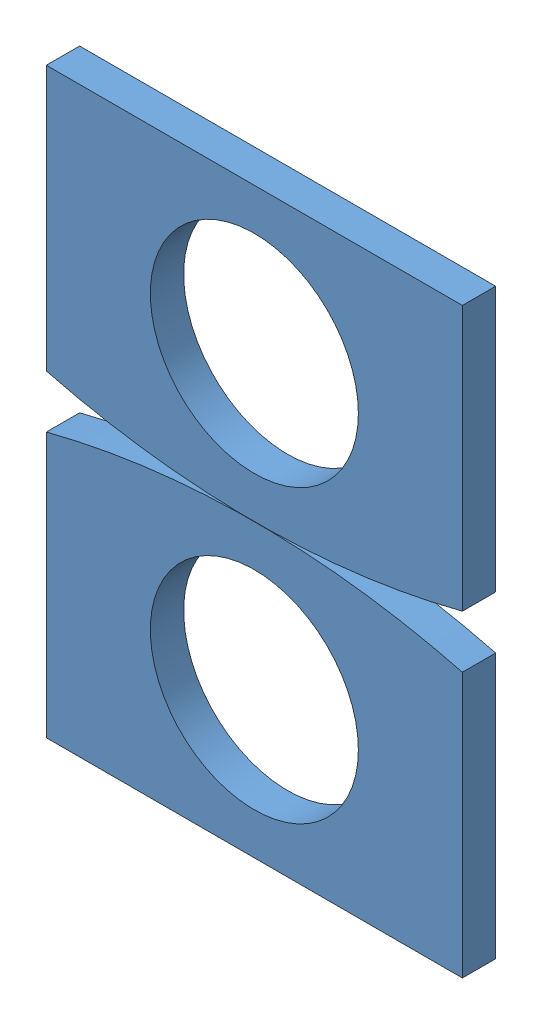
SolidWorks assembly TWO PLATES.SLDASM, configuration Default (file format 4400). Lengths in mm.
Overall size (50 70 4).
2 component instances, 1 part files, 3 mates.
Components (placement in the parent):
- PLATE-1: PLATE.SLDPRT [Default] at origin size (50 35 4)
- PLATE-2: PLATE.SLDPRT [Default] at (0 0 4) x (1 0 0) z (0 0 -1) size (50 35 4)
Mates (geometry in assembly coordinates):
- Coincident1: coincident aligned: plane of PLATE-1 through (0 100 4) normal (0 0 1); plane of PLATE-2 through (0 -100 4) normal (0 0 1)
- Coincident2: coincident aligned: plane of PLATE-1 through (25 3.1754 4) normal (1 0 0); plane of PLATE-2 through (25 -3.1754 0) normal (1 0 0)
- Tangent1: tangent anti-aligned: cylinder of PLATE-1 through (0 100 4) axis (0 0 -1) radius 100; cylinder of PLATE-2 through (0 -100 0) axis (0 0 1) radius 100
